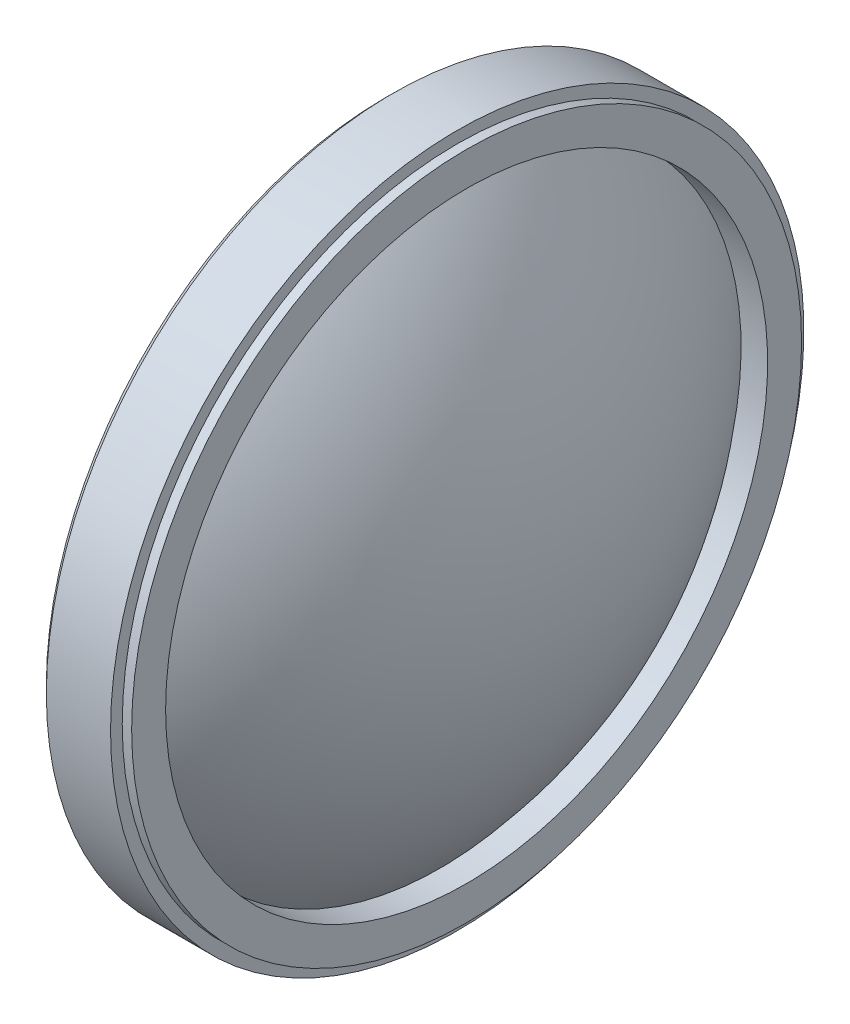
ISO-10303-21;
HEADER;
FILE_DESCRIPTION(('STEP AP214'),'2;1');
FILE_NAME('part.step','',(''),(''),'','','');
FILE_SCHEMA(('AUTOMOTIVE_DESIGN { 1 0 10303 214 1 1 1 1 }'));
ENDSEC;
DATA;
#1=APPLICATION_CONTEXT('core data for automotive mechanical design processes');
#2=APPLICATION_PROTOCOL_DEFINITION('international standard','automotive_design',2000,#1);
#3=PRODUCT_CONTEXT('',#1,'mechanical');
#4=PRODUCT('Part','Part','',(#3));
#5=PRODUCT_RELATED_PRODUCT_CATEGORY('part','',(#4));
#6=PRODUCT_DEFINITION_FORMATION('','',#4);
#7=PRODUCT_DEFINITION_CONTEXT('part definition',#1,'design');
#8=PRODUCT_DEFINITION('design','',#6,#7);
#9=PRODUCT_DEFINITION_SHAPE('','',#8);
#10=(LENGTH_UNIT() NAMED_UNIT(*) SI_UNIT(.MILLI.,.METRE.));
#11=(NAMED_UNIT(*) PLANE_ANGLE_UNIT() SI_UNIT($,.RADIAN.));
#12=(NAMED_UNIT(*) SI_UNIT($,.STERADIAN.) SOLID_ANGLE_UNIT());
#13=UNCERTAINTY_MEASURE_WITH_UNIT(LENGTH_MEASURE(1.E-05),#10,'distance_accuracy_value','');
#14=(GEOMETRIC_REPRESENTATION_CONTEXT(3) GLOBAL_UNCERTAINTY_ASSIGNED_CONTEXT((#13)) GLOBAL_UNIT_ASSIGNED_CONTEXT((#10,
#11,#12)) REPRESENTATION_CONTEXT('',''));
#15=CARTESIAN_POINT('',(0.,0.,0.));
#16=DIRECTION('',(0.,0.,1.));
#17=DIRECTION('',(1.,0.,0.));
#18=AXIS2_PLACEMENT_3D('',#15,#16,#17);
#19=CARTESIAN_POINT('',(-17.0504166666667,0.,0.));
#20=DIRECTION('',(-1.,0.,0.));
#21=DIRECTION('',(0.,1.,0.));
#22=AXIS2_PLACEMENT_3D('',#19,#20,#21);
#23=SPHERICAL_SURFACE('',#22,20.0504166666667);
#24=CARTESIAN_POINT('',(0.,0.,0.));
#25=DIRECTION('',(-1.,0.,0.));
#26=DIRECTION('',(0.,0.,1.));
#27=AXIS2_PLACEMENT_3D('',#24,#25,#26);
#28=CIRCLE('',#27,10.55);
#29=CARTESIAN_POINT('',(0.,0.,10.55));
#30=VERTEX_POINT('',#29);
#31=EDGE_CURVE('E79',#30,#30,#28,.T.);
#32=ORIENTED_EDGE('',*,*,#31,.T.);
#33=EDGE_LOOP('',(#32));
#34=FACE_BOUND('',#33,.T.);
#35=ADVANCED_FACE('F42',(#34),#23,.F.);
#36=CARTESIAN_POINT('',(-10.0128125,0.,0.));
#37=DIRECTION('',(-1.,0.,0.));
#38=DIRECTION('',(0.,1.,0.));
#39=AXIS2_PLACEMENT_3D('',#36,#37,#38);
#40=SPHERICAL_SURFACE('',#39,15.9128125);
#41=CARTESIAN_POINT('',(1.9,0.,0.));
#42=DIRECTION('',(-1.,0.,0.));
#43=DIRECTION('',(0.,0.,1.));
#44=AXIS2_PLACEMENT_3D('',#41,#42,#43);
#45=CIRCLE('',#44,10.55);
#46=CARTESIAN_POINT('',(1.9,0.,10.55));
#47=VERTEX_POINT('',#46);
#48=EDGE_CURVE('E56',#47,#47,#45,.T.);
#49=ORIENTED_EDGE('',*,*,#48,.F.);
#50=EDGE_LOOP('',(#49));
#51=FACE_BOUND('',#50,.T.);
#52=ADVANCED_FACE('F98',(#51),#40,.T.);
#53=CARTESIAN_POINT('',(-3.90719170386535,0.,0.));
#54=DIRECTION('',(-1.,0.,0.));
#55=DIRECTION('',(0.,0.,1.));
#56=AXIS2_PLACEMENT_3D('',#53,#54,#55);
#57=CYLINDRICAL_SURFACE('',#56,10.55);
#58=CARTESIAN_POINT('',(2.83,0.,0.));
#59=DIRECTION('',(-1.,0.,0.));
#60=DIRECTION('',(0.,0.,1.));
#61=AXIS2_PLACEMENT_3D('',#58,#59,#60);
#62=CIRCLE('',#61,10.55);
#63=CARTESIAN_POINT('',(2.83,0.,10.55));
#64=VERTEX_POINT('',#63);
#65=EDGE_CURVE('E61',#64,#64,#62,.T.);
#66=ORIENTED_EDGE('',*,*,#65,.F.);
#67=EDGE_LOOP('',(#66));
#68=FACE_BOUND('',#67,.T.);
#69=ORIENTED_EDGE('',*,*,#48,.T.);
#70=EDGE_LOOP('',(#69));
#71=FACE_BOUND('',#70,.T.);
#72=ADVANCED_FACE('F102',(#68,#71),#57,.F.);
#73=CARTESIAN_POINT('',(2.83,0.,0.));
#74=DIRECTION('',(-1.,0.,0.));
#75=DIRECTION('',(0.,0.,1.));
#76=AXIS2_PLACEMENT_3D('',#73,#74,#75);
#77=PLANE('',#76);
#78=CARTESIAN_POINT('',(2.83,0.,0.));
#79=DIRECTION('',(-1.,0.,0.));
#80=DIRECTION('',(0.,0.,1.));
#81=AXIS2_PLACEMENT_3D('',#78,#79,#80);
#82=CIRCLE('',#81,11.74);
#83=CARTESIAN_POINT('',(2.83,0.,11.74));
#84=VERTEX_POINT('',#83);
#85=EDGE_CURVE('E67',#84,#84,#82,.T.);
#86=ORIENTED_EDGE('',*,*,#85,.F.);
#87=EDGE_LOOP('',(#86));
#88=FACE_BOUND('',#87,.T.);
#89=ORIENTED_EDGE('',*,*,#65,.T.);
#90=EDGE_LOOP('',(#89));
#91=FACE_BOUND('',#90,.T.);
#92=ADVANCED_FACE('F108',(#88,#91),#77,.F.);
#93=CARTESIAN_POINT('',(-3.90719170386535,0.,0.));
#94=DIRECTION('',(-1.,0.,0.));
#95=DIRECTION('',(0.,0.,1.));
#96=AXIS2_PLACEMENT_3D('',#93,#94,#95);
#97=CYLINDRICAL_SURFACE('',#96,11.74);
#98=CARTESIAN_POINT('',(2.5,0.,0.));
#99=DIRECTION('',(-1.,0.,0.));
#100=DIRECTION('',(0.,0.,1.));
#101=AXIS2_PLACEMENT_3D('',#98,#99,#100);
#102=CIRCLE('',#101,11.74);
#103=CARTESIAN_POINT('',(2.5,0.,11.74));
#104=VERTEX_POINT('',#103);
#105=EDGE_CURVE('E71',#104,#104,#102,.T.);
#106=ORIENTED_EDGE('',*,*,#105,.F.);
#107=EDGE_LOOP('',(#106));
#108=FACE_BOUND('',#107,.T.);
#109=ORIENTED_EDGE('',*,*,#85,.T.);
#110=EDGE_LOOP('',(#109));
#111=FACE_BOUND('',#110,.T.);
#112=ADVANCED_FACE('F112',(#108,#111),#97,.T.);
#113=CARTESIAN_POINT('',(2.5,0.,0.));
#114=DIRECTION('',(-1.,0.,0.));
#115=DIRECTION('',(0.,0.,1.));
#116=AXIS2_PLACEMENT_3D('',#113,#114,#115);
#117=PLANE('',#116);
#118=CARTESIAN_POINT('',(2.5,0.,0.));
#119=DIRECTION('',(-1.,0.,0.));
#120=DIRECTION('',(0.,0.,1.));
#121=AXIS2_PLACEMENT_3D('',#118,#119,#120);
#122=CIRCLE('',#121,12.15);
#123=CARTESIAN_POINT('',(2.5,0.,12.15));
#124=VERTEX_POINT('',#123);
#125=EDGE_CURVE('E75',#124,#124,#122,.T.);
#126=ORIENTED_EDGE('',*,*,#125,.F.);
#127=EDGE_LOOP('',(#126));
#128=FACE_BOUND('',#127,.T.);
#129=ORIENTED_EDGE('',*,*,#105,.T.);
#130=EDGE_LOOP('',(#129));
#131=FACE_BOUND('',#130,.T.);
#132=ADVANCED_FACE('F95',(#128,#131),#117,.F.);
#133=CARTESIAN_POINT('',(-3.90719170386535,0.,0.));
#134=DIRECTION('',(-1.,0.,0.));
#135=DIRECTION('',(0.,0.,1.));
#136=AXIS2_PLACEMENT_3D('',#133,#134,#135);
#137=CYLINDRICAL_SURFACE('',#136,12.15);
#138=CARTESIAN_POINT('',(0.250000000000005,0.,0.));
#139=DIRECTION('',(-1.,0.,0.));
#140=DIRECTION('',(0.,0.,1.));
#141=AXIS2_PLACEMENT_3D('',#138,#139,#140);
#142=CIRCLE('',#141,12.15);
#143=CARTESIAN_POINT('',(0.250000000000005,0.,12.15));
#144=VERTEX_POINT('',#143);
#145=EDGE_CURVE('E10',#144,#144,#142,.F.);
#146=ORIENTED_EDGE('',*,*,#145,.T.);
#147=EDGE_LOOP('',(#146));
#148=FACE_BOUND('',#147,.T.);
#149=ORIENTED_EDGE('',*,*,#125,.T.);
#150=EDGE_LOOP('',(#149));
#151=FACE_BOUND('',#150,.T.);
#152=ADVANCED_FACE('F87',(#148,#151),#137,.T.);
#153=CARTESIAN_POINT('',(0.,0.,0.));
#154=DIRECTION('',(-1.,0.,0.));
#155=DIRECTION('',(0.,0.,1.));
#156=AXIS2_PLACEMENT_3D('',#153,#154,#155);
#157=PLANE('',#156);
#158=CARTESIAN_POINT('',(0.,0.,0.));
#159=DIRECTION('',(-1.,0.,0.));
#160=DIRECTION('',(0.,0.,1.));
#161=AXIS2_PLACEMENT_3D('',#158,#159,#160);
#162=CIRCLE('',#161,11.9);
#163=CARTESIAN_POINT('',(0.,0.,11.9));
#164=VERTEX_POINT('',#163);
#165=EDGE_CURVE('E51',#164,#164,#162,.T.);
#166=ORIENTED_EDGE('',*,*,#165,.T.);
#167=EDGE_LOOP('',(#166));
#168=FACE_BOUND('',#167,.T.);
#169=ORIENTED_EDGE('',*,*,#31,.F.);
#170=EDGE_LOOP('',(#169));
#171=FACE_BOUND('',#170,.T.);
#172=ADVANCED_FACE('F85',(#168,#171),#157,.T.);
#173=CARTESIAN_POINT('',(0.,0.,0.));
#174=DIRECTION('',(1.,0.,0.));
#175=DIRECTION('',(0.,0.,-1.));
#176=AXIS2_PLACEMENT_3D('',#173,#174,#175);
#177=CONICAL_SURFACE('',#176,11.9,0.785398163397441);
#178=ORIENTED_EDGE('',*,*,#145,.F.);
#179=EDGE_LOOP('',(#178));
#180=FACE_BOUND('',#179,.T.);
#181=ORIENTED_EDGE('',*,*,#165,.F.);
#182=EDGE_LOOP('',(#181));
#183=FACE_BOUND('',#182,.T.);
#184=ADVANCED_FACE('F45',(#180,#183),#177,.T.);
#185=CLOSED_SHELL('',(#35,#52,#72,#92,#112,#132,#152,#172,#184));
#186=MANIFOLD_SOLID_BREP('B2',#185);
#187=ADVANCED_BREP_SHAPE_REPRESENTATION('',(#18,#186),#14);
#188=SHAPE_DEFINITION_REPRESENTATION(#9,#187);
ENDSEC;
END-ISO-10303-21;
